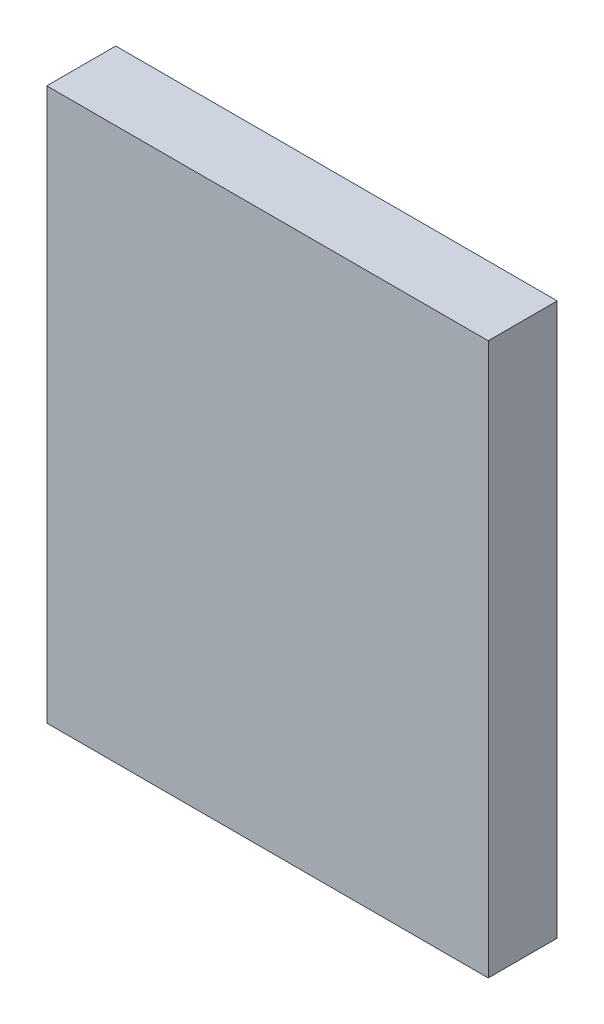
ISO-10303-21;
HEADER;
FILE_DESCRIPTION(('STEP AP214'),'2;1');
FILE_NAME('part.step','',(''),(''),'','','');
FILE_SCHEMA(('AUTOMOTIVE_DESIGN { 1 0 10303 214 1 1 1 1 }'));
ENDSEC;
DATA;
#1=APPLICATION_CONTEXT('core data for automotive mechanical design processes');
#2=APPLICATION_PROTOCOL_DEFINITION('international standard','automotive_design',2000,#1);
#3=PRODUCT_CONTEXT('',#1,'mechanical');
#4=PRODUCT('Part','Part','',(#3));
#5=PRODUCT_RELATED_PRODUCT_CATEGORY('part','',(#4));
#6=PRODUCT_DEFINITION_FORMATION('','',#4);
#7=PRODUCT_DEFINITION_CONTEXT('part definition',#1,'design');
#8=PRODUCT_DEFINITION('design','',#6,#7);
#9=PRODUCT_DEFINITION_SHAPE('','',#8);
#10=(LENGTH_UNIT() NAMED_UNIT(*) SI_UNIT(.MILLI.,.METRE.));
#11=(NAMED_UNIT(*) PLANE_ANGLE_UNIT() SI_UNIT($,.RADIAN.));
#12=(NAMED_UNIT(*) SI_UNIT($,.STERADIAN.) SOLID_ANGLE_UNIT());
#13=UNCERTAINTY_MEASURE_WITH_UNIT(LENGTH_MEASURE(1.E-05),#10,'distance_accuracy_value','');
#14=(GEOMETRIC_REPRESENTATION_CONTEXT(3) GLOBAL_UNCERTAINTY_ASSIGNED_CONTEXT((#13)) GLOBAL_UNIT_ASSIGNED_CONTEXT((#10,
#11,#12)) REPRESENTATION_CONTEXT('',''));
#15=CARTESIAN_POINT('',(0.,0.,0.));
#16=DIRECTION('',(0.,0.,1.));
#17=DIRECTION('',(1.,0.,0.));
#18=AXIS2_PLACEMENT_3D('',#15,#16,#17);
#19=CARTESIAN_POINT('',(0.,0.,12.5));
#20=DIRECTION('',(1.,0.,0.));
#21=DIRECTION('',(0.,0.,-1.));
#22=AXIS2_PLACEMENT_3D('',#19,#20,#21);
#23=PLANE('',#22);
#24=DIRECTION('',(0.,-1.,0.));
#25=VECTOR('',#24,1.);
#26=CARTESIAN_POINT('',(0.,0.,0.));
#27=LINE('',#26,#25);
#28=CARTESIAN_POINT('',(0.,100.,0.));
#29=VERTEX_POINT('',#28);
#30=CARTESIAN_POINT('',(0.,0.,0.));
#31=VERTEX_POINT('',#30);
#32=EDGE_CURVE('E77',#29,#31,#27,.T.);
#33=ORIENTED_EDGE('',*,*,#32,.T.);
#34=DIRECTION('',(0.,0.,-1.));
#35=VECTOR('',#34,1.);
#36=CARTESIAN_POINT('',(0.,0.,12.5));
#37=LINE('',#36,#35);
#38=CARTESIAN_POINT('',(0.,0.,12.5));
#39=VERTEX_POINT('',#38);
#40=EDGE_CURVE('E11',#39,#31,#37,.T.);
#41=ORIENTED_EDGE('',*,*,#40,.F.);
#42=DIRECTION('',(0.,-1.,0.));
#43=VECTOR('',#42,1.);
#44=CARTESIAN_POINT('',(0.,0.,12.5));
#45=LINE('',#44,#43);
#46=CARTESIAN_POINT('',(0.,100.,12.5));
#47=VERTEX_POINT('',#46);
#48=EDGE_CURVE('E95',#47,#39,#45,.T.);
#49=ORIENTED_EDGE('',*,*,#48,.F.);
#50=DIRECTION('',(0.,0.,-1.));
#51=VECTOR('',#50,1.);
#52=CARTESIAN_POINT('',(0.,100.,12.5));
#53=LINE('',#52,#51);
#54=EDGE_CURVE('E89',#47,#29,#53,.T.);
#55=ORIENTED_EDGE('',*,*,#54,.T.);
#56=EDGE_LOOP('',(#33,#41,#49,#55));
#57=FACE_BOUND('',#56,.T.);
#58=ADVANCED_FACE('F33',(#57),#23,.F.);
#59=CARTESIAN_POINT('',(0.,0.,12.5));
#60=DIRECTION('',(0.,1.,0.));
#61=DIRECTION('',(0.,0.,1.));
#62=AXIS2_PLACEMENT_3D('',#59,#60,#61);
#63=PLANE('',#62);
#64=DIRECTION('',(1.,0.,0.));
#65=VECTOR('',#64,1.);
#66=CARTESIAN_POINT('',(0.,0.,0.));
#67=LINE('',#66,#65);
#68=CARTESIAN_POINT('',(80.,0.,0.));
#69=VERTEX_POINT('',#68);
#70=EDGE_CURVE('E73',#31,#69,#67,.T.);
#71=ORIENTED_EDGE('',*,*,#70,.T.);
#72=DIRECTION('',(0.,0.,-1.));
#73=VECTOR('',#72,1.);
#74=CARTESIAN_POINT('',(80.,0.,12.5));
#75=LINE('',#74,#73);
#76=CARTESIAN_POINT('',(80.,0.,12.5));
#77=VERTEX_POINT('',#76);
#78=EDGE_CURVE('E40',#77,#69,#75,.T.);
#79=ORIENTED_EDGE('',*,*,#78,.F.);
#80=DIRECTION('',(1.,0.,0.));
#81=VECTOR('',#80,1.);
#82=CARTESIAN_POINT('',(0.,0.,12.5));
#83=LINE('',#82,#81);
#84=EDGE_CURVE('E85',#39,#77,#83,.T.);
#85=ORIENTED_EDGE('',*,*,#84,.F.);
#86=ORIENTED_EDGE('',*,*,#40,.T.);
#87=EDGE_LOOP('',(#71,#79,#85,#86));
#88=FACE_BOUND('',#87,.T.);
#89=ADVANCED_FACE('F84',(#88),#63,.F.);
#90=CARTESIAN_POINT('',(80.,0.,12.5));
#91=DIRECTION('',(-1.,0.,0.));
#92=DIRECTION('',(0.,0.,1.));
#93=AXIS2_PLACEMENT_3D('',#90,#91,#92);
#94=PLANE('',#93);
#95=DIRECTION('',(0.,1.,0.));
#96=VECTOR('',#95,1.);
#97=CARTESIAN_POINT('',(80.,0.,0.));
#98=LINE('',#97,#96);
#99=CARTESIAN_POINT('',(80.,100.,0.));
#100=VERTEX_POINT('',#99);
#101=EDGE_CURVE('E78',#69,#100,#98,.T.);
#102=ORIENTED_EDGE('',*,*,#101,.T.);
#103=DIRECTION('',(0.,0.,-1.));
#104=VECTOR('',#103,1.);
#105=CARTESIAN_POINT('',(80.,100.,12.5));
#106=LINE('',#105,#104);
#107=CARTESIAN_POINT('',(80.,100.,12.5));
#108=VERTEX_POINT('',#107);
#109=EDGE_CURVE('E101',#108,#100,#106,.T.);
#110=ORIENTED_EDGE('',*,*,#109,.F.);
#111=DIRECTION('',(0.,1.,0.));
#112=VECTOR('',#111,1.);
#113=CARTESIAN_POINT('',(80.,0.,12.5));
#114=LINE('',#113,#112);
#115=EDGE_CURVE('E52',#77,#108,#114,.T.);
#116=ORIENTED_EDGE('',*,*,#115,.F.);
#117=ORIENTED_EDGE('',*,*,#78,.T.);
#118=EDGE_LOOP('',(#102,#110,#116,#117));
#119=FACE_BOUND('',#118,.T.);
#120=ADVANCED_FACE('F104',(#119),#94,.F.);
#121=CARTESIAN_POINT('',(0.,100.,12.5));
#122=DIRECTION('',(0.,-1.,0.));
#123=DIRECTION('',(0.,0.,-1.));
#124=AXIS2_PLACEMENT_3D('',#121,#122,#123);
#125=PLANE('',#124);
#126=DIRECTION('',(-1.,0.,0.));
#127=VECTOR('',#126,1.);
#128=CARTESIAN_POINT('',(0.,100.,0.));
#129=LINE('',#128,#127);
#130=EDGE_CURVE('E93',#100,#29,#129,.T.);
#131=ORIENTED_EDGE('',*,*,#130,.T.);
#132=ORIENTED_EDGE('',*,*,#54,.F.);
#133=DIRECTION('',(-1.,0.,0.));
#134=VECTOR('',#133,1.);
#135=CARTESIAN_POINT('',(0.,100.,12.5));
#136=LINE('',#135,#134);
#137=EDGE_CURVE('E47',#108,#47,#136,.T.);
#138=ORIENTED_EDGE('',*,*,#137,.F.);
#139=ORIENTED_EDGE('',*,*,#109,.T.);
#140=EDGE_LOOP('',(#131,#132,#138,#139));
#141=FACE_BOUND('',#140,.T.);
#142=ADVANCED_FACE('F106',(#141),#125,.F.);
#143=CARTESIAN_POINT('',(0.,100.,12.5));
#144=DIRECTION('',(0.,0.,-1.));
#145=DIRECTION('',(-1.,0.,0.));
#146=AXIS2_PLACEMENT_3D('',#143,#144,#145);
#147=PLANE('',#146);
#148=ORIENTED_EDGE('',*,*,#48,.T.);
#149=ORIENTED_EDGE('',*,*,#84,.T.);
#150=ORIENTED_EDGE('',*,*,#115,.T.);
#151=ORIENTED_EDGE('',*,*,#137,.T.);
#152=EDGE_LOOP('',(#148,#149,#150,#151));
#153=FACE_BOUND('',#152,.T.);
#154=ADVANCED_FACE('F107',(#153),#147,.F.);
#155=CARTESIAN_POINT('',(0.,100.,0.));
#156=DIRECTION('',(0.,0.,-1.));
#157=DIRECTION('',(-1.,0.,0.));
#158=AXIS2_PLACEMENT_3D('',#155,#156,#157);
#159=PLANE('',#158);
#160=ORIENTED_EDGE('',*,*,#32,.F.);
#161=ORIENTED_EDGE('',*,*,#130,.F.);
#162=ORIENTED_EDGE('',*,*,#101,.F.);
#163=ORIENTED_EDGE('',*,*,#70,.F.);
#164=EDGE_LOOP('',(#160,#161,#162,#163));
#165=FACE_BOUND('',#164,.T.);
#166=ADVANCED_FACE('F74',(#165),#159,.T.);
#167=CLOSED_SHELL('',(#58,#89,#120,#142,#154,#166));
#168=MANIFOLD_SOLID_BREP('B2',#167);
#169=ADVANCED_BREP_SHAPE_REPRESENTATION('',(#18,#168),#14);
#170=SHAPE_DEFINITION_REPRESENTATION(#9,#169);
ENDSEC;
END-ISO-10303-21;
